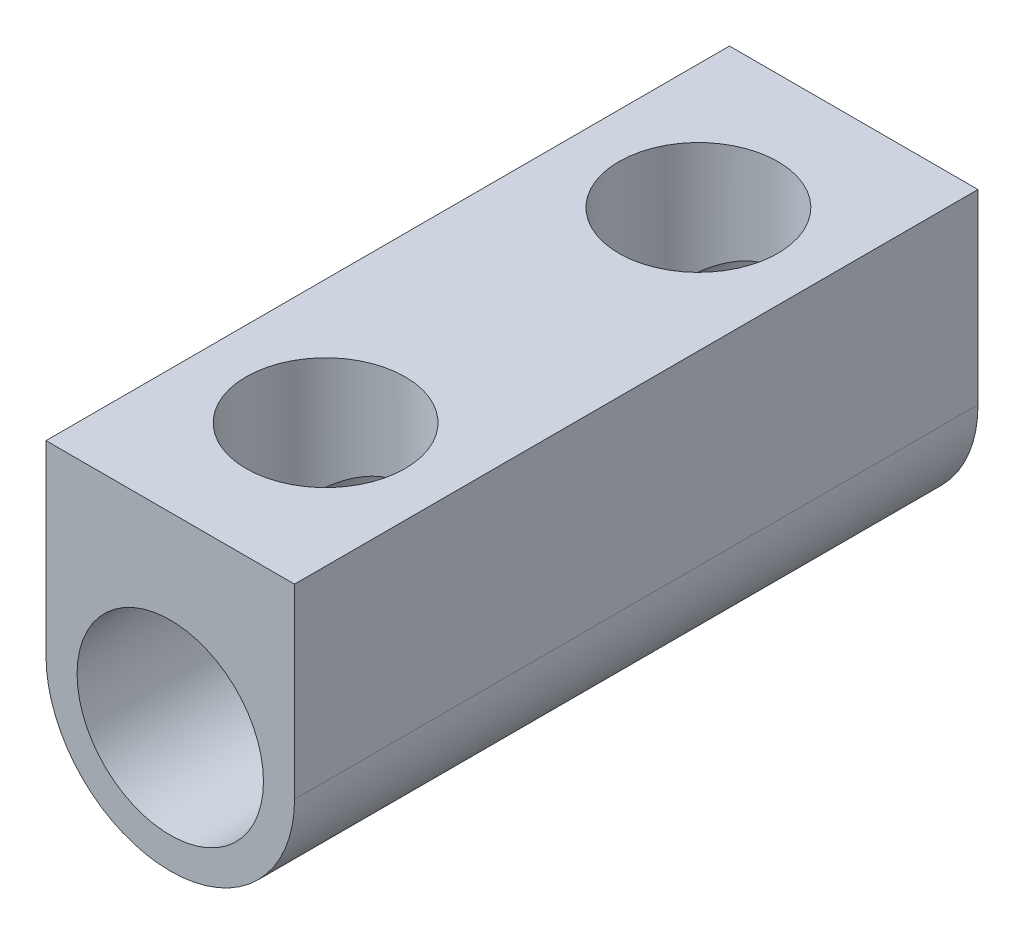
from build123d import *

# Parameters (mm, degrees)
ESQUISSE1_R                  = 1.5
BOSS_EXTRU_1_DEPTH           = 11
ENL_V_MAT_EXTRU_1_REACH      = 16.865
ENL_V_MAT_EXTRU_1_END_RADIUS = 1.5
ESQUISSE2_R                  = 1.28


with BuildPart() as part:
    # Esquisse1 → Boss.-Extru.1 (new body)
    with BuildSketch(Plane.XY):
        with BuildLine():
            Line((-8.658703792, 5.142857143), (-4.658703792, 5.142857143))
            Line((-4.658703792, 5.142857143), (-4.658703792, 2.142857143))
            ThreePointArc((-4.658703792, 2.142857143), (-6.658703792, 0.142857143), (-8.658703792, 2.142857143))
            Line((-8.658703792, 2.142857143), (-8.658703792, 5.142857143))
        make_face()
        with Locations((-6.658703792, 2.142857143)):
            Circle(ESQUISSE1_R, mode=Mode.SUBTRACT)
    extrude(amount=BOSS_EXTRU_1_DEPTH)

    # Enl_v. mat.-Extru.1: up to this cylinder (the profile starts outside it)
    enl_v_mat_extru_1_end = Plane(origin=(-6.658703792, 2.142857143, 11), z_dir=(0, 0, -1)) * Cylinder(ENL_V_MAT_EXTRU_1_END_RADIUS, 54.73, mode=Mode.PRIVATE)
    # Esquisse2 → Enl_v. mat.-Extru.1 (cut, up to the surface)
    with BuildSketch(Plane(origin=(0, 5.142857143, 0), x_dir=(1, 0, 0), z_dir=(0, 1, 0)), mode=Mode.PRIVATE) as enl_v_mat_extru_1_sk1:
        with Locations(Location((-6.658703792, -2.5, 0), (0, 0, 180))):
            Circle(ESQUISSE2_R)
    enl_v_mat_extru_1_tool1 = extrude(enl_v_mat_extru_1_sk1.sketch, amount=-ENL_V_MAT_EXTRU_1_REACH, mode=Mode.PRIVATE) - enl_v_mat_extru_1_end
    add(enl_v_mat_extru_1_tool1.solids().sort_by_distance((-6.658704, 5.142857, 2.5))[0], mode=Mode.SUBTRACT)
    # Esquisse2 → Enl_v. mat.-Extru.1 (cut, up to the surface)
    with BuildSketch(Plane(origin=(0, 5.142857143, 0), x_dir=(1, 0, 0), z_dir=(0, 1, 0)), mode=Mode.PRIVATE) as enl_v_mat_extru_1_sk2:
        with Locations((-6.658703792, -19.5)):
            Circle(ESQUISSE2_R)
    enl_v_mat_extru_1_tool2 = extrude(enl_v_mat_extru_1_sk2.sketch, amount=-ENL_V_MAT_EXTRU_1_REACH, mode=Mode.PRIVATE) - enl_v_mat_extru_1_end
    add(enl_v_mat_extru_1_tool2.solids().sort_by_distance((-6.658704, 5.142857, 19.5))[0], mode=Mode.SUBTRACT)
    # Esquisse2 → Enl_v. mat.-Extru.1 (cut, up to the surface)
    with BuildSketch(Plane(origin=(0, 5.142857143, 0), x_dir=(1, 0, 0), z_dir=(0, 1, 0)), mode=Mode.PRIVATE) as enl_v_mat_extru_1_sk3:
        with Locations(Location((-6.658703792, -8.5, 0), (0, 0, 180))):
            Circle(ESQUISSE2_R)
    enl_v_mat_extru_1_tool3 = extrude(enl_v_mat_extru_1_sk3.sketch, amount=-ENL_V_MAT_EXTRU_1_REACH, mode=Mode.PRIVATE) - enl_v_mat_extru_1_end
    add(enl_v_mat_extru_1_tool3.solids().sort_by_distance((-6.658704, 5.142857, 8.5))[0], mode=Mode.SUBTRACT)


solid = part.part
